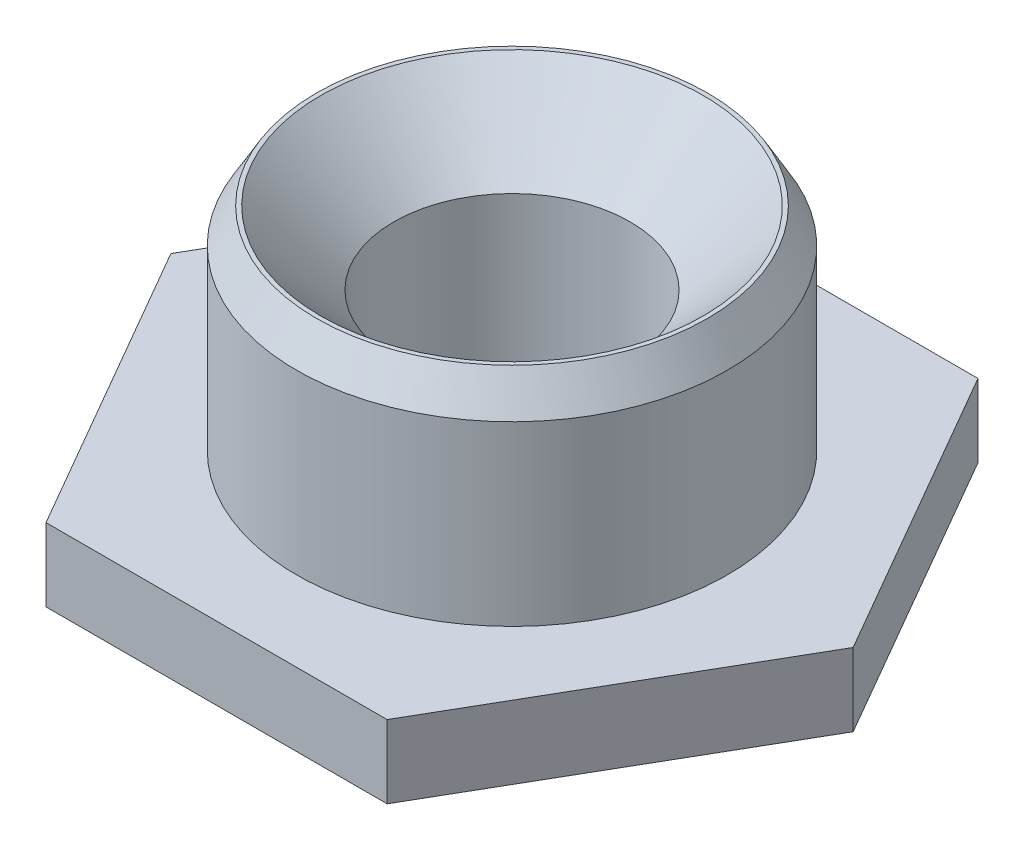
ISO-10303-21;
HEADER;
FILE_DESCRIPTION(('STEP AP214'),'2;1');
FILE_NAME('part.step','',(''),(''),'','','');
FILE_SCHEMA(('AUTOMOTIVE_DESIGN { 1 0 10303 214 1 1 1 1 }'));
ENDSEC;
DATA;
#1=APPLICATION_CONTEXT('core data for automotive mechanical design processes');
#2=APPLICATION_PROTOCOL_DEFINITION('international standard','automotive_design',2000,#1);
#3=PRODUCT_CONTEXT('',#1,'mechanical');
#4=PRODUCT('Part','Part','',(#3));
#5=PRODUCT_RELATED_PRODUCT_CATEGORY('part','',(#4));
#6=PRODUCT_DEFINITION_FORMATION('','',#4);
#7=PRODUCT_DEFINITION_CONTEXT('part definition',#1,'design');
#8=PRODUCT_DEFINITION('design','',#6,#7);
#9=PRODUCT_DEFINITION_SHAPE('','',#8);
#10=(LENGTH_UNIT() NAMED_UNIT(*) SI_UNIT(.MILLI.,.METRE.));
#11=(NAMED_UNIT(*) PLANE_ANGLE_UNIT() SI_UNIT($,.RADIAN.));
#12=(NAMED_UNIT(*) SI_UNIT($,.STERADIAN.) SOLID_ANGLE_UNIT());
#13=UNCERTAINTY_MEASURE_WITH_UNIT(LENGTH_MEASURE(1.E-05),#10,'distance_accuracy_value','');
#14=(GEOMETRIC_REPRESENTATION_CONTEXT(3) GLOBAL_UNCERTAINTY_ASSIGNED_CONTEXT((#13)) GLOBAL_UNIT_ASSIGNED_CONTEXT((#10,
#11,#12)) REPRESENTATION_CONTEXT('',''));
#15=CARTESIAN_POINT('',(0.,0.,0.));
#16=DIRECTION('',(0.,0.,1.));
#17=DIRECTION('',(1.,0.,0.));
#18=AXIS2_PLACEMENT_3D('',#15,#16,#17);
#19=CARTESIAN_POINT('',(0.,8.2,0.));
#20=DIRECTION('',(0.,1.,0.));
#21=DIRECTION('',(0.,0.,1.));
#22=AXIS2_PLACEMENT_3D('',#19,#20,#21);
#23=PLANE('',#22);
#24=CARTESIAN_POINT('',(0.,8.19999999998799,0.));
#25=DIRECTION('',(0.,-1.,0.));
#26=DIRECTION('',(0.,0.,-1.));
#27=AXIS2_PLACEMENT_3D('',#24,#25,#26);
#28=CIRCLE('',#27,5.62264973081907);
#29=CARTESIAN_POINT('',(0.,8.19999999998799,-5.62264973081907));
#30=VERTEX_POINT('',#29);
#31=EDGE_CURVE('E19',#30,#30,#28,.T.);
#32=ORIENTED_EDGE('',*,*,#31,.F.);
#33=EDGE_LOOP('',(#32));
#34=FACE_BOUND('',#33,.T.);
#35=CARTESIAN_POINT('',(0.,8.19999999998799,0.));
#36=DIRECTION('',(0.,1.,0.));
#37=DIRECTION('',(0.,0.,1.));
#38=AXIS2_PLACEMENT_3D('',#35,#36,#37);
#39=CIRCLE('',#38,5.50000000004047);
#40=CARTESIAN_POINT('',(0.,8.19999999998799,5.50000000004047));
#41=VERTEX_POINT('',#40);
#42=EDGE_CURVE('E102',#41,#41,#39,.F.);
#43=ORIENTED_EDGE('',*,*,#42,.T.);
#44=EDGE_LOOP('',(#43));
#45=FACE_BOUND('',#44,.T.);
#46=ADVANCED_FACE('F16',(#34,#45),#23,.T.);
#47=CARTESIAN_POINT('',(0.,7.20000000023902,0.));
#48=DIRECTION('',(0.,-1.,0.));
#49=DIRECTION('',(0.,0.,-1.));
#50=AXIS2_PLACEMENT_3D('',#47,#48,#49);
#51=CONICAL_SURFACE('',#50,6.19999999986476,0.523598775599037);
#52=CARTESIAN_POINT('',(0.,7.2,0.));
#53=DIRECTION('',(0.,-1.,0.));
#54=DIRECTION('',(0.,0.,-1.));
#55=AXIS2_PLACEMENT_3D('',#52,#53,#54);
#56=CIRCLE('',#55,6.2);
#57=CARTESIAN_POINT('',(0.,7.2,-6.2));
#58=VERTEX_POINT('',#57);
#59=EDGE_CURVE('E99',#58,#58,#56,.T.);
#60=ORIENTED_EDGE('',*,*,#59,.F.);
#61=EDGE_LOOP('',(#60));
#62=FACE_BOUND('',#61,.T.);
#63=ORIENTED_EDGE('',*,*,#31,.T.);
#64=EDGE_LOOP('',(#63));
#65=FACE_BOUND('',#64,.T.);
#66=ADVANCED_FACE('F114',(#62,#65),#51,.T.);
#67=CARTESIAN_POINT('',(0.,8.20000000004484,0.));
#68=DIRECTION('',(0.,1.,0.));
#69=DIRECTION('',(0.,0.,1.));
#70=AXIS2_PLACEMENT_3D('',#67,#68,#69);
#71=CONICAL_SURFACE('',#70,5.50000000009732,0.785398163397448);
#72=ORIENTED_EDGE('',*,*,#42,.F.);
#73=EDGE_LOOP('',(#72));
#74=FACE_BOUND('',#73,.T.);
#75=CARTESIAN_POINT('',(0.,6.1,0.));
#76=DIRECTION('',(0.,1.,0.));
#77=DIRECTION('',(0.,0.,1.));
#78=AXIS2_PLACEMENT_3D('',#75,#76,#77);
#79=CIRCLE('',#78,3.4);
#80=CARTESIAN_POINT('',(0.,6.1,3.4));
#81=VERTEX_POINT('',#80);
#82=EDGE_CURVE('E96',#81,#81,#79,.F.);
#83=ORIENTED_EDGE('',*,*,#82,.T.);
#84=EDGE_LOOP('',(#83));
#85=FACE_BOUND('',#84,.T.);
#86=ADVANCED_FACE('F121',(#74,#85),#71,.F.);
#87=CARTESIAN_POINT('',(0.,8.2,0.));
#88=DIRECTION('',(0.,-1.,0.));
#89=DIRECTION('',(0.,0.,-1.));
#90=AXIS2_PLACEMENT_3D('',#87,#88,#89);
#91=CYLINDRICAL_SURFACE('',#90,6.2);
#92=CARTESIAN_POINT('',(0.,2.1,0.));
#93=DIRECTION('',(0.,-1.,0.));
#94=DIRECTION('',(0.,0.,-1.));
#95=AXIS2_PLACEMENT_3D('',#92,#93,#94);
#96=CIRCLE('',#95,6.2);
#97=CARTESIAN_POINT('',(0.,2.1,-6.2));
#98=VERTEX_POINT('',#97);
#99=EDGE_CURVE('E95',#98,#98,#96,.T.);
#100=ORIENTED_EDGE('',*,*,#99,.F.);
#101=EDGE_LOOP('',(#100));
#102=FACE_BOUND('',#101,.T.);
#103=ORIENTED_EDGE('',*,*,#59,.T.);
#104=EDGE_LOOP('',(#103));
#105=FACE_BOUND('',#104,.T.);
#106=ADVANCED_FACE('F161',(#102,#105),#91,.T.);
#107=CARTESIAN_POINT('',(0.,8.2,0.));
#108=DIRECTION('',(0.,1.,0.));
#109=DIRECTION('',(0.,0.,1.));
#110=AXIS2_PLACEMENT_3D('',#107,#108,#109);
#111=CYLINDRICAL_SURFACE('',#110,3.4);
#112=ORIENTED_EDGE('',*,*,#82,.F.);
#113=EDGE_LOOP('',(#112));
#114=FACE_BOUND('',#113,.T.);
#115=CARTESIAN_POINT('',(0.,1.10000000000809,0.));
#116=DIRECTION('',(0.,-1.,0.));
#117=DIRECTION('',(0.,0.,-1.));
#118=AXIS2_PLACEMENT_3D('',#115,#116,#117);
#119=CIRCLE('',#118,3.39999999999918);
#120=CARTESIAN_POINT('',(0.,1.10000000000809,-3.39999999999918));
#121=VERTEX_POINT('',#120);
#122=EDGE_CURVE('E78',#121,#121,#119,.T.);
#123=ORIENTED_EDGE('',*,*,#122,.T.);
#124=EDGE_LOOP('',(#123));
#125=FACE_BOUND('',#124,.T.);
#126=ADVANCED_FACE('F158',(#114,#125),#111,.F.);
#127=CARTESIAN_POINT('',(0.,2.1,0.));
#128=DIRECTION('',(0.,1.,0.));
#129=DIRECTION('',(0.,0.,1.));
#130=AXIS2_PLACEMENT_3D('',#127,#128,#129);
#131=PLANE('',#130);
#132=DIRECTION('',(-0.5,0.,-0.866025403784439));
#133=VECTOR('',#132,1.);
#134=CARTESIAN_POINT('',(-9.81495457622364,2.1,0.));
#135=LINE('',#134,#133);
#136=CARTESIAN_POINT('',(-9.81495457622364,2.1,0.));
#137=VERTEX_POINT('',#136);
#138=CARTESIAN_POINT('',(-4.90747728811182,2.1,8.5));
#139=VERTEX_POINT('',#138);
#140=EDGE_CURVE('E310',#137,#139,#135,.F.);
#141=ORIENTED_EDGE('',*,*,#140,.T.);
#142=DIRECTION('',(-1.,0.,0.));
#143=VECTOR('',#142,1.);
#144=CARTESIAN_POINT('',(-4.90747728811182,2.1,8.5));
#145=LINE('',#144,#143);
#146=CARTESIAN_POINT('',(4.90747728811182,2.1,8.5));
#147=VERTEX_POINT('',#146);
#148=EDGE_CURVE('E318',#139,#147,#145,.F.);
#149=ORIENTED_EDGE('',*,*,#148,.T.);
#150=DIRECTION('',(-0.5,0.,0.866025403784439));
#151=VECTOR('',#150,1.);
#152=CARTESIAN_POINT('',(4.90747728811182,2.1,8.5));
#153=LINE('',#152,#151);
#154=CARTESIAN_POINT('',(9.81495457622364,2.1,0.));
#155=VERTEX_POINT('',#154);
#156=EDGE_CURVE('E72',#147,#155,#153,.F.);
#157=ORIENTED_EDGE('',*,*,#156,.T.);
#158=DIRECTION('',(0.5,0.,0.866025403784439));
#159=VECTOR('',#158,1.);
#160=CARTESIAN_POINT('',(9.81495457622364,2.1,0.));
#161=LINE('',#160,#159);
#162=CARTESIAN_POINT('',(4.90747728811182,2.1,-8.5));
#163=VERTEX_POINT('',#162);
#164=EDGE_CURVE('E69',#155,#163,#161,.F.);
#165=ORIENTED_EDGE('',*,*,#164,.T.);
#166=DIRECTION('',(1.,0.,0.));
#167=VECTOR('',#166,1.);
#168=CARTESIAN_POINT('',(4.90747728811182,2.1,-8.5));
#169=LINE('',#168,#167);
#170=CARTESIAN_POINT('',(-4.90747728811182,2.1,-8.5));
#171=VERTEX_POINT('',#170);
#172=EDGE_CURVE('E66',#163,#171,#169,.F.);
#173=ORIENTED_EDGE('',*,*,#172,.T.);
#174=DIRECTION('',(0.5,0.,-0.866025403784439));
#175=VECTOR('',#174,1.);
#176=CARTESIAN_POINT('',(-4.90747728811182,2.1,-8.5));
#177=LINE('',#176,#175);
#178=EDGE_CURVE('E304',#171,#137,#177,.F.);
#179=ORIENTED_EDGE('',*,*,#178,.T.);
#180=EDGE_LOOP('',(#141,#149,#157,#165,#173,#179));
#181=FACE_BOUND('',#180,.T.);
#182=ORIENTED_EDGE('',*,*,#99,.T.);
#183=EDGE_LOOP('',(#182));
#184=FACE_BOUND('',#183,.T.);
#185=ADVANCED_FACE('F70',(#181,#184),#131,.T.);
#186=CARTESIAN_POINT('',(0.,5.6843418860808E-11,0.));
#187=DIRECTION('',(0.,-1.,0.));
#188=DIRECTION('',(0.,0.,-1.));
#189=AXIS2_PLACEMENT_3D('',#186,#187,#188);
#190=CONICAL_SURFACE('',#189,4.49999999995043,0.785398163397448);
#191=CARTESIAN_POINT('',(0.,0.,0.));
#192=DIRECTION('',(0.,-1.,0.));
#193=DIRECTION('',(0.,0.,-1.));
#194=AXIS2_PLACEMENT_3D('',#191,#192,#193);
#195=CIRCLE('',#194,4.50000000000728);
#196=CARTESIAN_POINT('',(0.,0.,-4.50000000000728));
#197=VERTEX_POINT('',#196);
#198=EDGE_CURVE('E103',#197,#197,#195,.T.);
#199=ORIENTED_EDGE('',*,*,#198,.T.);
#200=EDGE_LOOP('',(#199));
#201=FACE_BOUND('',#200,.T.);
#202=ORIENTED_EDGE('',*,*,#122,.F.);
#203=EDGE_LOOP('',(#202));
#204=FACE_BOUND('',#203,.T.);
#205=ADVANCED_FACE('F152',(#201,#204),#190,.F.);
#206=CARTESIAN_POINT('',(9.81495457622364,2.1,0.));
#207=DIRECTION('',(-0.866025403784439,0.,0.5));
#208=DIRECTION('',(0.5,0.,0.866025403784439));
#209=AXIS2_PLACEMENT_3D('',#206,#207,#208);
#210=PLANE('',#209);
#211=DIRECTION('',(0.,1.,0.));
#212=VECTOR('',#211,1.);
#213=CARTESIAN_POINT('',(4.90747728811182,2.1,-8.5));
#214=LINE('',#213,#212);
#215=CARTESIAN_POINT('',(4.90747728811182,0.,-8.5));
#216=VERTEX_POINT('',#215);
#217=EDGE_CURVE('E77',#216,#163,#214,.T.);
#218=ORIENTED_EDGE('',*,*,#217,.T.);
#219=ORIENTED_EDGE('',*,*,#164,.F.);
#220=DIRECTION('',(0.,1.,0.));
#221=VECTOR('',#220,1.);
#222=CARTESIAN_POINT('',(9.81495457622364,2.1,0.));
#223=LINE('',#222,#221);
#224=CARTESIAN_POINT('',(9.81495457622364,0.,0.));
#225=VERTEX_POINT('',#224);
#226=EDGE_CURVE('E106',#155,#225,#223,.F.);
#227=ORIENTED_EDGE('',*,*,#226,.T.);
#228=DIRECTION('',(-0.5,0.,-0.866025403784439));
#229=VECTOR('',#228,1.);
#230=CARTESIAN_POINT('',(9.81495457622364,0.,0.));
#231=LINE('',#230,#229);
#232=EDGE_CURVE('E89',#225,#216,#231,.T.);
#233=ORIENTED_EDGE('',*,*,#232,.T.);
#234=EDGE_LOOP('',(#218,#219,#227,#233));
#235=FACE_BOUND('',#234,.T.);
#236=ADVANCED_FACE('F88',(#235),#210,.F.);
#237=CARTESIAN_POINT('',(4.90747728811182,2.1,-8.5));
#238=DIRECTION('',(0.,0.,1.));
#239=DIRECTION('',(1.,0.,0.));
#240=AXIS2_PLACEMENT_3D('',#237,#238,#239);
#241=PLANE('',#240);
#242=DIRECTION('',(0.,1.,0.));
#243=VECTOR('',#242,1.);
#244=CARTESIAN_POINT('',(-4.90747728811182,2.1,-8.5));
#245=LINE('',#244,#243);
#246=CARTESIAN_POINT('',(-4.90747728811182,0.,-8.5));
#247=VERTEX_POINT('',#246);
#248=EDGE_CURVE('E85',#247,#171,#245,.T.);
#249=ORIENTED_EDGE('',*,*,#248,.T.);
#250=ORIENTED_EDGE('',*,*,#172,.F.);
#251=ORIENTED_EDGE('',*,*,#217,.F.);
#252=DIRECTION('',(1.,0.,0.));
#253=VECTOR('',#252,1.);
#254=CARTESIAN_POINT('',(0.,0.,-8.5));
#255=LINE('',#254,#253);
#256=EDGE_CURVE('E324',#216,#247,#255,.F.);
#257=ORIENTED_EDGE('',*,*,#256,.T.);
#258=EDGE_LOOP('',(#249,#250,#251,#257));
#259=FACE_BOUND('',#258,.T.);
#260=ADVANCED_FACE('F82',(#259),#241,.F.);
#261=CARTESIAN_POINT('',(-4.90747728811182,2.1,-8.5));
#262=DIRECTION('',(0.866025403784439,0.,0.5));
#263=DIRECTION('',(0.5,0.,-0.866025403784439));
#264=AXIS2_PLACEMENT_3D('',#261,#262,#263);
#265=PLANE('',#264);
#266=DIRECTION('',(0.,1.,0.));
#267=VECTOR('',#266,1.);
#268=CARTESIAN_POINT('',(-9.81495457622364,2.1,0.));
#269=LINE('',#268,#267);
#270=CARTESIAN_POINT('',(-9.81495457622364,0.,0.));
#271=VERTEX_POINT('',#270);
#272=EDGE_CURVE('E303',#271,#137,#269,.T.);
#273=ORIENTED_EDGE('',*,*,#272,.T.);
#274=ORIENTED_EDGE('',*,*,#178,.F.);
#275=ORIENTED_EDGE('',*,*,#248,.F.);
#276=DIRECTION('',(-0.5,0.,0.866025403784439));
#277=VECTOR('',#276,1.);
#278=CARTESIAN_POINT('',(-4.90747728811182,0.,-8.5));
#279=LINE('',#278,#277);
#280=EDGE_CURVE('E306',#247,#271,#279,.T.);
#281=ORIENTED_EDGE('',*,*,#280,.T.);
#282=EDGE_LOOP('',(#273,#274,#275,#281));
#283=FACE_BOUND('',#282,.T.);
#284=ADVANCED_FACE('F143',(#283),#265,.F.);
#285=CARTESIAN_POINT('',(-9.81495457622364,2.1,0.));
#286=DIRECTION('',(0.866025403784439,0.,-0.5));
#287=DIRECTION('',(-0.5,0.,-0.866025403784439));
#288=AXIS2_PLACEMENT_3D('',#285,#286,#287);
#289=PLANE('',#288);
#290=DIRECTION('',(0.,1.,0.));
#291=VECTOR('',#290,1.);
#292=CARTESIAN_POINT('',(-4.90747728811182,2.1,8.5));
#293=LINE('',#292,#291);
#294=CARTESIAN_POINT('',(-4.90747728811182,0.,8.5));
#295=VERTEX_POINT('',#294);
#296=EDGE_CURVE('E312',#295,#139,#293,.T.);
#297=ORIENTED_EDGE('',*,*,#296,.T.);
#298=ORIENTED_EDGE('',*,*,#140,.F.);
#299=ORIENTED_EDGE('',*,*,#272,.F.);
#300=DIRECTION('',(0.5,0.,0.866025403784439));
#301=VECTOR('',#300,1.);
#302=CARTESIAN_POINT('',(-9.81495457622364,0.,0.));
#303=LINE('',#302,#301);
#304=EDGE_CURVE('E327',#271,#295,#303,.T.);
#305=ORIENTED_EDGE('',*,*,#304,.T.);
#306=EDGE_LOOP('',(#297,#298,#299,#305));
#307=FACE_BOUND('',#306,.T.);
#308=ADVANCED_FACE('F139',(#307),#289,.F.);
#309=CARTESIAN_POINT('',(-4.90747728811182,2.1,8.5));
#310=DIRECTION('',(0.,0.,-1.));
#311=DIRECTION('',(-1.,0.,0.));
#312=AXIS2_PLACEMENT_3D('',#309,#310,#311);
#313=PLANE('',#312);
#314=DIRECTION('',(0.,1.,0.));
#315=VECTOR('',#314,1.);
#316=CARTESIAN_POINT('',(4.90747728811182,2.1,8.5));
#317=LINE('',#316,#315);
#318=CARTESIAN_POINT('',(4.90747728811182,0.,8.5));
#319=VERTEX_POINT('',#318);
#320=EDGE_CURVE('E33',#319,#147,#317,.T.);
#321=ORIENTED_EDGE('',*,*,#320,.T.);
#322=ORIENTED_EDGE('',*,*,#148,.F.);
#323=ORIENTED_EDGE('',*,*,#296,.F.);
#324=DIRECTION('',(1.,0.,0.));
#325=VECTOR('',#324,1.);
#326=CARTESIAN_POINT('',(0.,0.,8.5));
#327=LINE('',#326,#325);
#328=EDGE_CURVE('E25',#295,#319,#327,.T.);
#329=ORIENTED_EDGE('',*,*,#328,.T.);
#330=EDGE_LOOP('',(#321,#322,#323,#329));
#331=FACE_BOUND('',#330,.T.);
#332=ADVANCED_FACE('F132',(#331),#313,.F.);
#333=CARTESIAN_POINT('',(4.90747728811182,2.1,8.5));
#334=DIRECTION('',(-0.866025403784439,0.,-0.5));
#335=DIRECTION('',(-0.5,0.,0.866025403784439));
#336=AXIS2_PLACEMENT_3D('',#333,#334,#335);
#337=PLANE('',#336);
#338=ORIENTED_EDGE('',*,*,#226,.F.);
#339=ORIENTED_EDGE('',*,*,#156,.F.);
#340=ORIENTED_EDGE('',*,*,#320,.F.);
#341=DIRECTION('',(0.5,0.,-0.866025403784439));
#342=VECTOR('',#341,1.);
#343=CARTESIAN_POINT('',(4.90747728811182,0.,8.5));
#344=LINE('',#343,#342);
#345=EDGE_CURVE('E11',#319,#225,#344,.T.);
#346=ORIENTED_EDGE('',*,*,#345,.T.);
#347=EDGE_LOOP('',(#338,#339,#340,#346));
#348=FACE_BOUND('',#347,.T.);
#349=ADVANCED_FACE('F125',(#348),#337,.F.);
#350=CARTESIAN_POINT('',(0.,0.,0.));
#351=DIRECTION('',(0.,1.,0.));
#352=DIRECTION('',(0.,0.,1.));
#353=AXIS2_PLACEMENT_3D('',#350,#351,#352);
#354=PLANE('',#353);
#355=ORIENTED_EDGE('',*,*,#328,.F.);
#356=ORIENTED_EDGE('',*,*,#304,.F.);
#357=ORIENTED_EDGE('',*,*,#280,.F.);
#358=ORIENTED_EDGE('',*,*,#256,.F.);
#359=ORIENTED_EDGE('',*,*,#232,.F.);
#360=ORIENTED_EDGE('',*,*,#345,.F.);
#361=EDGE_LOOP('',(#355,#356,#357,#358,#359,#360));
#362=FACE_BOUND('',#361,.T.);
#363=ORIENTED_EDGE('',*,*,#198,.F.);
#364=EDGE_LOOP('',(#363));
#365=FACE_BOUND('',#364,.T.);
#366=ADVANCED_FACE('F123',(#362,#365),#354,.F.);
#367=CLOSED_SHELL('',(#46,#66,#86,#106,#126,#185,#205,#236,#260,#284,#308,#332,#349,#366));
#368=MANIFOLD_SOLID_BREP('B1',#367);
#369=ADVANCED_BREP_SHAPE_REPRESENTATION('',(#18,#368),#14);
#370=SHAPE_DEFINITION_REPRESENTATION(#9,#369);
ENDSEC;
END-ISO-10303-21;
